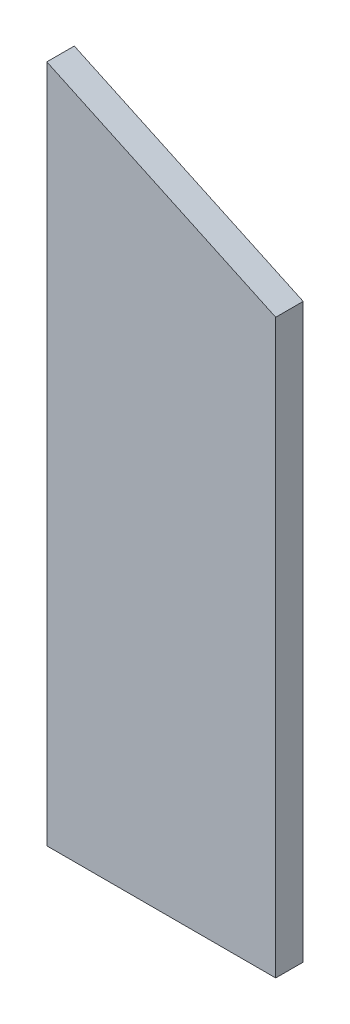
ISO-10303-21;
HEADER;
FILE_DESCRIPTION(('STEP AP214'),'2;1');
FILE_NAME('part.step','',(''),(''),'','','');
FILE_SCHEMA(('AUTOMOTIVE_DESIGN { 1 0 10303 214 1 1 1 1 }'));
ENDSEC;
DATA;
#1=APPLICATION_CONTEXT('core data for automotive mechanical design processes');
#2=APPLICATION_PROTOCOL_DEFINITION('international standard','automotive_design',2000,#1);
#3=PRODUCT_CONTEXT('',#1,'mechanical');
#4=PRODUCT('Part','Part','',(#3));
#5=PRODUCT_RELATED_PRODUCT_CATEGORY('part','',(#4));
#6=PRODUCT_DEFINITION_FORMATION('','',#4);
#7=PRODUCT_DEFINITION_CONTEXT('part definition',#1,'design');
#8=PRODUCT_DEFINITION('design','',#6,#7);
#9=PRODUCT_DEFINITION_SHAPE('','',#8);
#10=(LENGTH_UNIT() NAMED_UNIT(*) SI_UNIT(.MILLI.,.METRE.));
#11=(NAMED_UNIT(*) PLANE_ANGLE_UNIT() SI_UNIT($,.RADIAN.));
#12=(NAMED_UNIT(*) SI_UNIT($,.STERADIAN.) SOLID_ANGLE_UNIT());
#13=UNCERTAINTY_MEASURE_WITH_UNIT(LENGTH_MEASURE(1.E-05),#10,'distance_accuracy_value','');
#14=(GEOMETRIC_REPRESENTATION_CONTEXT(3) GLOBAL_UNCERTAINTY_ASSIGNED_CONTEXT((#13)) GLOBAL_UNIT_ASSIGNED_CONTEXT((#10,
#11,#12)) REPRESENTATION_CONTEXT('',''));
#15=CARTESIAN_POINT('',(0.,0.,0.));
#16=DIRECTION('',(0.,0.,1.));
#17=DIRECTION('',(1.,0.,0.));
#18=AXIS2_PLACEMENT_3D('',#15,#16,#17);
#19=CARTESIAN_POINT('',(-100.,0.,12.));
#20=DIRECTION('',(0.,1.,0.));
#21=DIRECTION('',(0.,0.,1.));
#22=AXIS2_PLACEMENT_3D('',#19,#20,#21);
#23=PLANE('',#22);
#24=DIRECTION('',(1.,0.,0.));
#25=VECTOR('',#24,1.);
#26=CARTESIAN_POINT('',(-100.,0.,0.));
#27=LINE('',#26,#25);
#28=CARTESIAN_POINT('',(-100.,0.,0.));
#29=VERTEX_POINT('',#28);
#30=CARTESIAN_POINT('',(0.,0.,0.));
#31=VERTEX_POINT('',#30);
#32=EDGE_CURVE('E107',#29,#31,#27,.T.);
#33=ORIENTED_EDGE('',*,*,#32,.T.);
#34=DIRECTION('',(0.,0.,-1.));
#35=VECTOR('',#34,1.);
#36=CARTESIAN_POINT('',(0.,0.,12.));
#37=LINE('',#36,#35);
#38=CARTESIAN_POINT('',(0.,0.,12.));
#39=VERTEX_POINT('',#38);
#40=EDGE_CURVE('E11',#39,#31,#37,.T.);
#41=ORIENTED_EDGE('',*,*,#40,.F.);
#42=DIRECTION('',(1.,0.,0.));
#43=VECTOR('',#42,1.);
#44=CARTESIAN_POINT('',(-100.,0.,12.));
#45=LINE('',#44,#43);
#46=CARTESIAN_POINT('',(-100.,0.,12.));
#47=VERTEX_POINT('',#46);
#48=EDGE_CURVE('E91',#47,#39,#45,.T.);
#49=ORIENTED_EDGE('',*,*,#48,.F.);
#50=DIRECTION('',(0.,0.,-1.));
#51=VECTOR('',#50,1.);
#52=CARTESIAN_POINT('',(-100.,0.,12.));
#53=LINE('',#52,#51);
#54=EDGE_CURVE('E103',#47,#29,#53,.T.);
#55=ORIENTED_EDGE('',*,*,#54,.T.);
#56=EDGE_LOOP('',(#33,#41,#49,#55));
#57=FACE_BOUND('',#56,.T.);
#58=ADVANCED_FACE('F39',(#57),#23,.F.);
#59=CARTESIAN_POINT('',(0.,0.,12.));
#60=DIRECTION('',(-1.,0.,0.));
#61=DIRECTION('',(0.,0.,1.));
#62=AXIS2_PLACEMENT_3D('',#59,#60,#61);
#63=PLANE('',#62);
#64=DIRECTION('',(0.,1.,0.));
#65=VECTOR('',#64,1.);
#66=CARTESIAN_POINT('',(0.,0.,0.));
#67=LINE('',#66,#65);
#68=CARTESIAN_POINT('',(0.,250.,0.));
#69=VERTEX_POINT('',#68);
#70=EDGE_CURVE('E96',#31,#69,#67,.T.);
#71=ORIENTED_EDGE('',*,*,#70,.T.);
#72=DIRECTION('',(0.,0.,-1.));
#73=VECTOR('',#72,1.);
#74=CARTESIAN_POINT('',(0.,250.,12.));
#75=LINE('',#74,#73);
#76=CARTESIAN_POINT('',(0.,250.,12.));
#77=VERTEX_POINT('',#76);
#78=EDGE_CURVE('E48',#77,#69,#75,.T.);
#79=ORIENTED_EDGE('',*,*,#78,.F.);
#80=DIRECTION('',(0.,1.,0.));
#81=VECTOR('',#80,1.);
#82=CARTESIAN_POINT('',(0.,0.,12.));
#83=LINE('',#82,#81);
#84=EDGE_CURVE('E86',#39,#77,#83,.T.);
#85=ORIENTED_EDGE('',*,*,#84,.F.);
#86=ORIENTED_EDGE('',*,*,#40,.T.);
#87=EDGE_LOOP('',(#71,#79,#85,#86));
#88=FACE_BOUND('',#87,.T.);
#89=ADVANCED_FACE('F95',(#88),#63,.F.);
#90=CARTESIAN_POINT('',(0.,250.,12.));
#91=DIRECTION('',(-0.4226182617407,-0.90630778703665,0.));
#92=DIRECTION('',(0.90630778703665,-0.4226182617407,0.));
#93=AXIS2_PLACEMENT_3D('',#90,#91,#92);
#94=PLANE('',#93);
#95=DIRECTION('',(-0.90630778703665,0.4226182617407,0.));
#96=VECTOR('',#95,1.);
#97=CARTESIAN_POINT('',(0.,250.,0.));
#98=LINE('',#97,#96);
#99=CARTESIAN_POINT('',(-100.,296.6307658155,0.));
#100=VERTEX_POINT('',#99);
#101=EDGE_CURVE('E73',#69,#100,#98,.T.);
#102=ORIENTED_EDGE('',*,*,#101,.T.);
#103=DIRECTION('',(0.,0.,-1.));
#104=VECTOR('',#103,1.);
#105=CARTESIAN_POINT('',(-100.,296.6307658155,12.));
#106=LINE('',#105,#104);
#107=CARTESIAN_POINT('',(-100.,296.6307658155,12.));
#108=VERTEX_POINT('',#107);
#109=EDGE_CURVE('E98',#108,#100,#106,.T.);
#110=ORIENTED_EDGE('',*,*,#109,.F.);
#111=DIRECTION('',(-0.90630778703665,0.4226182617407,0.));
#112=VECTOR('',#111,1.);
#113=CARTESIAN_POINT('',(0.,250.,12.));
#114=LINE('',#113,#112);
#115=EDGE_CURVE('E89',#77,#108,#114,.T.);
#116=ORIENTED_EDGE('',*,*,#115,.F.);
#117=ORIENTED_EDGE('',*,*,#78,.T.);
#118=EDGE_LOOP('',(#102,#110,#116,#117));
#119=FACE_BOUND('',#118,.T.);
#120=ADVANCED_FACE('F99',(#119),#94,.F.);
#121=CARTESIAN_POINT('',(-100.,296.6307658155,12.));
#122=DIRECTION('',(1.,0.,0.));
#123=DIRECTION('',(0.,1.,0.));
#124=AXIS2_PLACEMENT_3D('',#121,#122,#123);
#125=PLANE('',#124);
#126=DIRECTION('',(0.,-1.,0.));
#127=VECTOR('',#126,1.);
#128=CARTESIAN_POINT('',(-100.,296.6307658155,0.));
#129=LINE('',#128,#127);
#130=EDGE_CURVE('E79',#100,#29,#129,.T.);
#131=ORIENTED_EDGE('',*,*,#130,.T.);
#132=ORIENTED_EDGE('',*,*,#54,.F.);
#133=DIRECTION('',(0.,-1.,0.));
#134=VECTOR('',#133,1.);
#135=CARTESIAN_POINT('',(-100.,296.6307658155,12.));
#136=LINE('',#135,#134);
#137=EDGE_CURVE('E56',#108,#47,#136,.T.);
#138=ORIENTED_EDGE('',*,*,#137,.F.);
#139=ORIENTED_EDGE('',*,*,#109,.T.);
#140=EDGE_LOOP('',(#131,#132,#138,#139));
#141=FACE_BOUND('',#140,.T.);
#142=ADVANCED_FACE('F120',(#141),#125,.F.);
#143=CARTESIAN_POINT('',(0.,0.,12.));
#144=DIRECTION('',(0.,0.,1.));
#145=DIRECTION('',(1.,0.,0.));
#146=AXIS2_PLACEMENT_3D('',#143,#144,#145);
#147=PLANE('',#146);
#148=ORIENTED_EDGE('',*,*,#48,.T.);
#149=ORIENTED_EDGE('',*,*,#84,.T.);
#150=ORIENTED_EDGE('',*,*,#115,.T.);
#151=ORIENTED_EDGE('',*,*,#137,.T.);
#152=EDGE_LOOP('',(#148,#149,#150,#151));
#153=FACE_BOUND('',#152,.T.);
#154=ADVANCED_FACE('F87',(#153),#147,.T.);
#155=CARTESIAN_POINT('',(0.,0.,0.));
#156=DIRECTION('',(0.,0.,1.));
#157=DIRECTION('',(1.,0.,0.));
#158=AXIS2_PLACEMENT_3D('',#155,#156,#157);
#159=PLANE('',#158);
#160=ORIENTED_EDGE('',*,*,#32,.F.);
#161=ORIENTED_EDGE('',*,*,#130,.F.);
#162=ORIENTED_EDGE('',*,*,#101,.F.);
#163=ORIENTED_EDGE('',*,*,#70,.F.);
#164=EDGE_LOOP('',(#160,#161,#162,#163));
#165=FACE_BOUND('',#164,.T.);
#166=ADVANCED_FACE('F123',(#165),#159,.F.);
#167=CLOSED_SHELL('',(#58,#89,#120,#142,#154,#166));
#168=MANIFOLD_SOLID_BREP('B2',#167);
#169=ADVANCED_BREP_SHAPE_REPRESENTATION('',(#18,#168),#14);
#170=SHAPE_DEFINITION_REPRESENTATION(#9,#169);
ENDSEC;
END-ISO-10303-21;
